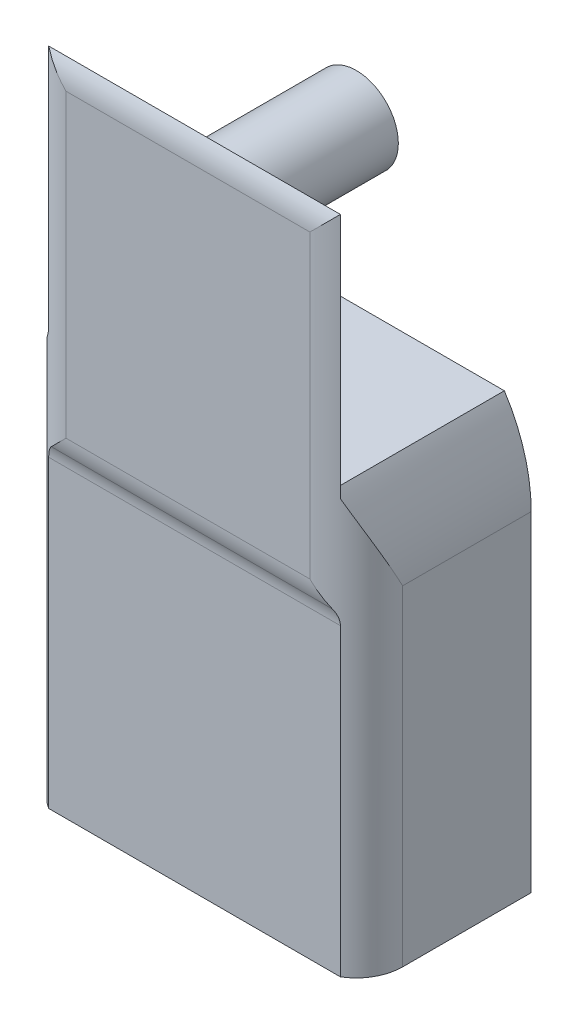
ISO-10303-21;
HEADER;
FILE_DESCRIPTION(('STEP AP214'),'2;1');
FILE_NAME('part.step','',(''),(''),'','','');
FILE_SCHEMA(('AUTOMOTIVE_DESIGN { 1 0 10303 214 1 1 1 1 }'));
ENDSEC;
DATA;
#1=APPLICATION_CONTEXT('core data for automotive mechanical design processes');
#2=APPLICATION_PROTOCOL_DEFINITION('international standard','automotive_design',2000,#1);
#3=PRODUCT_CONTEXT('',#1,'mechanical');
#4=PRODUCT('Part','Part','',(#3));
#5=PRODUCT_RELATED_PRODUCT_CATEGORY('part','',(#4));
#6=PRODUCT_DEFINITION_FORMATION('','',#4);
#7=PRODUCT_DEFINITION_CONTEXT('part definition',#1,'design');
#8=PRODUCT_DEFINITION('design','',#6,#7);
#9=PRODUCT_DEFINITION_SHAPE('','',#8);
#10=(LENGTH_UNIT() NAMED_UNIT(*) SI_UNIT(.MILLI.,.METRE.));
#11=(NAMED_UNIT(*) PLANE_ANGLE_UNIT() SI_UNIT($,.RADIAN.));
#12=(NAMED_UNIT(*) SI_UNIT($,.STERADIAN.) SOLID_ANGLE_UNIT());
#13=UNCERTAINTY_MEASURE_WITH_UNIT(LENGTH_MEASURE(1.E-05),#10,'distance_accuracy_value','');
#14=(GEOMETRIC_REPRESENTATION_CONTEXT(3) GLOBAL_UNCERTAINTY_ASSIGNED_CONTEXT((#13)) GLOBAL_UNIT_ASSIGNED_CONTEXT((#10,
#11,#12)) REPRESENTATION_CONTEXT('',''));
#15=CARTESIAN_POINT('',(0.,0.,0.));
#16=DIRECTION('',(0.,0.,1.));
#17=DIRECTION('',(1.,0.,0.));
#18=AXIS2_PLACEMENT_3D('',#15,#16,#17);
#19=CARTESIAN_POINT('',(25.4,49.8,25.4));
#20=DIRECTION('',(0.,0.,-1.));
#21=DIRECTION('',(-1.,0.,0.));
#22=AXIS2_PLACEMENT_3D('',#19,#20,#21);
#23=CYLINDRICAL_SURFACE('',#22,25.4);
#24=DIRECTION('',(0.,0.,-1.));
#25=VECTOR('',#24,1.);
#26=CARTESIAN_POINT('',(0.,49.8,25.4));
#27=LINE('',#26,#25);
#28=CARTESIAN_POINT('',(0.,49.8,19.4));
#29=VERTEX_POINT('',#28);
#30=CARTESIAN_POINT('',(0.,49.8,0.));
#31=VERTEX_POINT('',#30);
#32=EDGE_CURVE('E188',#29,#31,#27,.T.);
#33=ORIENTED_EDGE('',*,*,#32,.F.);
#34=CARTESIAN_POINT('',(3.39444872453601,62.4852557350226,25.4));
#35=CARTESIAN_POINT('',(3.25261574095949,62.2392116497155,25.3147540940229));
#36=CARTESIAN_POINT('',(3.11551853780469,61.9918488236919,25.2255386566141));
#37=CARTESIAN_POINT('',(2.85071777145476,61.4948343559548,25.0400028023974));
#38=CARTESIAN_POINT('',(2.72301238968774,61.24518316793,24.943683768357));
#39=CARTESIAN_POINT('',(2.47698744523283,60.7440996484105,24.7448421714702));
#40=CARTESIAN_POINT('',(2.35865847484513,60.4926693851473,24.6423260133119));
#41=CARTESIAN_POINT('',(2.13112207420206,59.9880292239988,24.4317056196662));
#42=CARTESIAN_POINT('',(2.02191514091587,59.7348192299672,24.3236010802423));
#43=CARTESIAN_POINT('',(1.70820183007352,58.9738431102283,23.9923087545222));
#44=CARTESIAN_POINT('',(1.51709934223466,58.4637011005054,23.7617289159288));
#45=CARTESIAN_POINT('',(1.16977300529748,57.4386590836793,23.2852791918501));
#46=CARTESIAN_POINT('',(1.01355929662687,56.9237577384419,23.0394048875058));
#47=CARTESIAN_POINT('',(0.72793303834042,55.8634934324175,22.5229328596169));
#48=CARTESIAN_POINT('',(0.600340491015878,55.3179408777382,22.2517144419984));
#49=CARTESIAN_POINT('',(0.382062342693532,54.2242426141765,21.7001943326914));
#50=CARTESIAN_POINT('',(0.291377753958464,53.6760968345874,21.4198923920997));
#51=CARTESIAN_POINT('',(0.0738786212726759,52.0297838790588,20.5705382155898));
#52=CARTESIAN_POINT('',(0.00123755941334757,50.9283089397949,19.9923249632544));
#53=CARTESIAN_POINT('',(5.22997711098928E-06,49.8188147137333,19.409877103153));
#54=CARTESIAN_POINT('',(3.8196601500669E-09,49.8094073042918,19.4049385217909));
#55=CARTESIAN_POINT('',(0.,49.8,19.4));
#56=B_SPLINE_CURVE_WITH_KNOTS('',3,(#34,#35,#36,#37,#38,#39,#40,#41,#42,#43,#44,#45,#46,#47,#48,
#49,#50,#51,#52,#53,#54,#55),.UNSPECIFIED.,.F.,.F.,(4,2,2,2,2,2,2,2,2,2,4),(0.,
0.889433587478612,1.77869449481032,2.66705156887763,3.55545700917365,5.32862058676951,
7.10229886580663,8.96837070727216,10.8344937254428,14.5618344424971,14.5937092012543),.UNSPECIFIED.);
#57=CARTESIAN_POINT('',(3.39444872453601,62.4852557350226,25.4));
#58=VERTEX_POINT('',#57);
#59=EDGE_CURVE('E12',#29,#58,#56,.F.);
#60=ORIENTED_EDGE('',*,*,#59,.T.);
#61=CARTESIAN_POINT('',(25.4,49.8,25.4));
#62=DIRECTION('',(0.,0.,-1.));
#63=DIRECTION('',(-1.,0.,0.));
#64=AXIS2_PLACEMENT_3D('',#61,#62,#63);
#65=CIRCLE('',#64,25.4);
#66=CARTESIAN_POINT('',(4.05145125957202,63.5622478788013,25.4));
#67=VERTEX_POINT('',#66);
#68=EDGE_CURVE('E189',#67,#58,#65,.F.);
#69=ORIENTED_EDGE('',*,*,#68,.F.);
#70=DIRECTION('',(0.,0.,-1.));
#71=VECTOR('',#70,1.);
#72=CARTESIAN_POINT('',(4.05145125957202,63.5622478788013,25.4));
#73=LINE('',#72,#71);
#74=CARTESIAN_POINT('',(4.05145125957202,63.5622478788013,0.));
#75=VERTEX_POINT('',#74);
#76=EDGE_CURVE('E196',#67,#75,#73,.T.);
#77=ORIENTED_EDGE('',*,*,#76,.T.);
#78=CARTESIAN_POINT('',(25.4,49.8,0.));
#79=DIRECTION('',(0.,0.,-1.));
#80=DIRECTION('',(-1.,0.,0.));
#81=AXIS2_PLACEMENT_3D('',#78,#79,#80);
#82=CIRCLE('',#81,25.4);
#83=EDGE_CURVE('E209',#75,#31,#82,.F.);
#84=ORIENTED_EDGE('',*,*,#83,.T.);
#85=EDGE_LOOP('',(#33,#60,#69,#77,#84));
#86=FACE_BOUND('',#85,.T.);
#87=ADVANCED_FACE('F79',(#86),#23,.T.);
#88=CARTESIAN_POINT('',(0.,0.,0.));
#89=DIRECTION('',(0.,0.,1.));
#90=DIRECTION('',(1.,0.,0.));
#91=AXIS2_PLACEMENT_3D('',#88,#89,#90);
#92=PLANE('',#91);
#93=ORIENTED_EDGE('',*,*,#83,.F.);
#94=DIRECTION('',(-1.,0.,0.));
#95=VECTOR('',#94,1.);
#96=CARTESIAN_POINT('',(46.748548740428,63.5622478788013,0.));
#97=LINE('',#96,#95);
#98=CARTESIAN_POINT('',(46.748548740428,63.5622478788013,0.));
#99=VERTEX_POINT('',#98);
#100=EDGE_CURVE('E198',#99,#75,#97,.T.);
#101=ORIENTED_EDGE('',*,*,#100,.F.);
#102=CARTESIAN_POINT('',(50.8,49.8,0.));
#103=VERTEX_POINT('',#102);
#104=EDGE_CURVE('E203',#103,#99,#82,.F.);
#105=ORIENTED_EDGE('',*,*,#104,.F.);
#106=DIRECTION('',(0.,1.,0.));
#107=VECTOR('',#106,1.);
#108=CARTESIAN_POINT('',(50.8,0.,0.));
#109=LINE('',#108,#107);
#110=CARTESIAN_POINT('',(50.8,0.,0.));
#111=VERTEX_POINT('',#110);
#112=EDGE_CURVE('E226',#111,#103,#109,.T.);
#113=ORIENTED_EDGE('',*,*,#112,.F.);
#114=DIRECTION('',(1.,0.,0.));
#115=VECTOR('',#114,1.);
#116=CARTESIAN_POINT('',(0.,0.,0.));
#117=LINE('',#116,#115);
#118=CARTESIAN_POINT('',(0.,0.,0.));
#119=VERTEX_POINT('',#118);
#120=EDGE_CURVE('E229',#119,#111,#117,.T.);
#121=ORIENTED_EDGE('',*,*,#120,.F.);
#122=DIRECTION('',(0.,-1.,0.));
#123=VECTOR('',#122,1.);
#124=CARTESIAN_POINT('',(0.,0.,0.));
#125=LINE('',#124,#123);
#126=EDGE_CURVE('E221',#31,#119,#125,.T.);
#127=ORIENTED_EDGE('',*,*,#126,.F.);
#128=EDGE_LOOP('',(#93,#101,#105,#113,#121,#127));
#129=FACE_BOUND('',#128,.T.);
#130=ADVANCED_FACE('F301',(#129),#92,.F.);
#131=CARTESIAN_POINT('',(0.,0.,25.4));
#132=DIRECTION('',(1.,0.,0.));
#133=DIRECTION('',(0.,1.,0.));
#134=AXIS2_PLACEMENT_3D('',#131,#132,#133);
#135=PLANE('',#134);
#136=DIRECTION('',(0.,0.,-1.));
#137=VECTOR('',#136,1.);
#138=CARTESIAN_POINT('',(0.,0.,25.4));
#139=LINE('',#138,#137);
#140=CARTESIAN_POINT('',(0.,0.,19.4));
#141=VERTEX_POINT('',#140);
#142=EDGE_CURVE('E235',#141,#119,#139,.T.);
#143=ORIENTED_EDGE('',*,*,#142,.F.);
#144=DIRECTION('',(0.,-1.,0.));
#145=VECTOR('',#144,1.);
#146=CARTESIAN_POINT('',(0.,99.6378787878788,19.4));
#147=LINE('',#146,#145);
#148=EDGE_CURVE('E89',#141,#29,#147,.F.);
#149=ORIENTED_EDGE('',*,*,#148,.T.);
#150=ORIENTED_EDGE('',*,*,#32,.T.);
#151=ORIENTED_EDGE('',*,*,#126,.T.);
#152=EDGE_LOOP('',(#143,#149,#150,#151));
#153=FACE_BOUND('',#152,.T.);
#154=ADVANCED_FACE('F304',(#153),#135,.F.);
#155=CARTESIAN_POINT('',(0.,0.,25.4));
#156=DIRECTION('',(0.,1.,0.));
#157=DIRECTION('',(0.,0.,1.));
#158=AXIS2_PLACEMENT_3D('',#155,#156,#157);
#159=PLANE('',#158);
#160=DIRECTION('',(0.,0.,-1.));
#161=VECTOR('',#160,1.);
#162=CARTESIAN_POINT('',(50.8,0.,25.4));
#163=LINE('',#162,#161);
#164=CARTESIAN_POINT('',(50.8,0.,19.4));
#165=VERTEX_POINT('',#164);
#166=EDGE_CURVE('E225',#165,#111,#163,.T.);
#167=ORIENTED_EDGE('',*,*,#166,.F.);
#168=CARTESIAN_POINT('',(43.8,0.,19.4));
#169=DIRECTION('',(0.,1.,0.));
#170=DIRECTION('',(0.,0.,1.));
#171=AXIS2_PLACEMENT_3D('',#168,#169,#170);
#172=CIRCLE('',#171,7.);
#173=CARTESIAN_POINT('',(47.405551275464,0.,25.4));
#174=VERTEX_POINT('',#173);
#175=EDGE_CURVE('E325',#165,#174,#172,.F.);
#176=ORIENTED_EDGE('',*,*,#175,.T.);
#177=DIRECTION('',(1.,0.,0.));
#178=VECTOR('',#177,1.);
#179=CARTESIAN_POINT('',(0.,0.,25.4));
#180=LINE('',#179,#178);
#181=CARTESIAN_POINT('',(3.39444872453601,0.,25.4));
#182=VERTEX_POINT('',#181);
#183=EDGE_CURVE('E222',#182,#174,#180,.T.);
#184=ORIENTED_EDGE('',*,*,#183,.F.);
#185=CARTESIAN_POINT('',(7.,0.,19.4));
#186=DIRECTION('',(0.,1.,0.));
#187=DIRECTION('',(0.,0.,1.));
#188=AXIS2_PLACEMENT_3D('',#185,#186,#187);
#189=CIRCLE('',#188,7.);
#190=EDGE_CURVE('E324',#182,#141,#189,.F.);
#191=ORIENTED_EDGE('',*,*,#190,.T.);
#192=ORIENTED_EDGE('',*,*,#142,.T.);
#193=ORIENTED_EDGE('',*,*,#120,.T.);
#194=EDGE_LOOP('',(#167,#176,#184,#191,#192,#193));
#195=FACE_BOUND('',#194,.T.);
#196=ADVANCED_FACE('F322',(#195),#159,.F.);
#197=CARTESIAN_POINT('',(50.8,0.,25.4));
#198=DIRECTION('',(-1.,0.,0.));
#199=DIRECTION('',(0.,0.,1.));
#200=AXIS2_PLACEMENT_3D('',#197,#198,#199);
#201=PLANE('',#200);
#202=DIRECTION('',(0.,0.,-1.));
#203=VECTOR('',#202,1.);
#204=CARTESIAN_POINT('',(50.8,49.8,25.4));
#205=LINE('',#204,#203);
#206=CARTESIAN_POINT('',(50.8,49.8,19.4));
#207=VERTEX_POINT('',#206);
#208=EDGE_CURVE('E205',#207,#103,#205,.T.);
#209=ORIENTED_EDGE('',*,*,#208,.F.);
#210=DIRECTION('',(0.,1.,0.));
#211=VECTOR('',#210,1.);
#212=CARTESIAN_POINT('',(50.8,48.8937448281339,19.4));
#213=LINE('',#212,#211);
#214=EDGE_CURVE('E260',#207,#165,#213,.F.);
#215=ORIENTED_EDGE('',*,*,#214,.T.);
#216=ORIENTED_EDGE('',*,*,#166,.T.);
#217=ORIENTED_EDGE('',*,*,#112,.T.);
#218=EDGE_LOOP('',(#209,#215,#216,#217));
#219=FACE_BOUND('',#218,.T.);
#220=ADVANCED_FACE('F319',(#219),#201,.F.);
#221=CARTESIAN_POINT('',(0.,0.,25.4));
#222=DIRECTION('',(0.,0.,1.));
#223=DIRECTION('',(1.,0.,0.));
#224=AXIS2_PLACEMENT_3D('',#221,#222,#223);
#225=PLANE('',#224);
#226=ORIENTED_EDGE('',*,*,#183,.T.);
#227=DIRECTION('',(0.,-1.,0.));
#228=VECTOR('',#227,1.);
#229=CARTESIAN_POINT('',(47.405551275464,0.,25.4));
#230=LINE('',#229,#228);
#231=CARTESIAN_POINT('',(47.405551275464,45.8937448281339,25.4));
#232=VERTEX_POINT('',#231);
#233=EDGE_CURVE('E330',#174,#232,#230,.F.);
#234=ORIENTED_EDGE('',*,*,#233,.T.);
#235=DIRECTION('',(-1.,0.,0.));
#236=VECTOR('',#235,1.);
#237=CARTESIAN_POINT('',(0.,45.8937448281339,25.4));
#238=LINE('',#237,#236);
#239=CARTESIAN_POINT('',(3.39444872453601,45.8937448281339,25.4));
#240=VERTEX_POINT('',#239);
#241=EDGE_CURVE('E237',#232,#240,#238,.T.);
#242=ORIENTED_EDGE('',*,*,#241,.T.);
#243=DIRECTION('',(0.,1.,0.));
#244=VECTOR('',#243,1.);
#245=CARTESIAN_POINT('',(3.39444872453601,45.8937448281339,25.4));
#246=LINE('',#245,#244);
#247=EDGE_CURVE('E326',#240,#182,#246,.F.);
#248=ORIENTED_EDGE('',*,*,#247,.T.);
#249=EDGE_LOOP('',(#226,#234,#242,#248));
#250=FACE_BOUND('',#249,.T.);
#251=ADVANCED_FACE('F351',(#250),#225,.T.);
#252=CARTESIAN_POINT('',(0.,0.,26.4));
#253=DIRECTION('',(0.,0.,1.));
#254=DIRECTION('',(1.,0.,0.));
#255=AXIS2_PLACEMENT_3D('',#252,#253,#254);
#256=PLANE('',#255);
#257=DIRECTION('',(-1.,0.,0.));
#258=VECTOR('',#257,1.);
#259=CARTESIAN_POINT('',(50.8,50.6895763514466,26.4));
#260=LINE('',#259,#258);
#261=CARTESIAN_POINT('',(7.,50.6895763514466,26.4));
#262=VERTEX_POINT('',#261);
#263=CARTESIAN_POINT('',(43.8,50.6895763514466,26.4));
#264=VERTEX_POINT('',#263);
#265=EDGE_CURVE('E244',#262,#264,#260,.F.);
#266=ORIENTED_EDGE('',*,*,#265,.T.);
#267=DIRECTION('',(0.,1.,0.));
#268=VECTOR('',#267,1.);
#269=CARTESIAN_POINT('',(43.8,99.6378787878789,26.4));
#270=LINE('',#269,#268);
#271=CARTESIAN_POINT('',(43.8,96.0323275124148,26.4));
#272=VERTEX_POINT('',#271);
#273=EDGE_CURVE('E246',#264,#272,#270,.T.);
#274=ORIENTED_EDGE('',*,*,#273,.T.);
#275=DIRECTION('',(-1.,0.,0.));
#276=VECTOR('',#275,1.);
#277=CARTESIAN_POINT('',(0.,96.0323275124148,26.4));
#278=LINE('',#277,#276);
#279=CARTESIAN_POINT('',(7.,96.0323275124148,26.4));
#280=VERTEX_POINT('',#279);
#281=EDGE_CURVE('E240',#272,#280,#278,.T.);
#282=ORIENTED_EDGE('',*,*,#281,.T.);
#283=DIRECTION('',(0.,-1.,0.));
#284=VECTOR('',#283,1.);
#285=CARTESIAN_POINT('',(7.,48.8937448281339,26.4));
#286=LINE('',#285,#284);
#287=EDGE_CURVE('E242',#280,#262,#286,.T.);
#288=ORIENTED_EDGE('',*,*,#287,.T.);
#289=EDGE_LOOP('',(#266,#274,#282,#288));
#290=FACE_BOUND('',#289,.T.);
#291=ADVANCED_FACE('F355',(#290),#256,.T.);
#292=CARTESIAN_POINT('',(0.,0.,25.4));
#293=DIRECTION('',(0.,0.,1.));
#294=DIRECTION('',(1.,0.,0.));
#295=AXIS2_PLACEMENT_3D('',#292,#293,#294);
#296=PLANE('',#295);
#297=DIRECTION('',(1.,0.,0.));
#298=VECTOR('',#297,1.);
#299=CARTESIAN_POINT('',(0.,99.6378787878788,25.4));
#300=LINE('',#299,#298);
#301=CARTESIAN_POINT('',(3.39444872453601,99.6378787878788,25.4));
#302=VERTEX_POINT('',#301);
#303=CARTESIAN_POINT('',(47.405551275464,99.6378787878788,25.4));
#304=VERTEX_POINT('',#303);
#305=EDGE_CURVE('E219',#302,#304,#300,.T.);
#306=ORIENTED_EDGE('',*,*,#305,.T.);
#307=DIRECTION('',(0.,-1.,0.));
#308=VECTOR('',#307,1.);
#309=CARTESIAN_POINT('',(47.405551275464,99.6378787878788,25.4));
#310=LINE('',#309,#308);
#311=CARTESIAN_POINT('',(47.405551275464,62.4852557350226,25.4));
#312=VERTEX_POINT('',#311);
#313=EDGE_CURVE('E184',#304,#312,#310,.T.);
#314=ORIENTED_EDGE('',*,*,#313,.T.);
#315=CARTESIAN_POINT('',(46.748548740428,63.5622478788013,25.4));
#316=VERTEX_POINT('',#315);
#317=EDGE_CURVE('E176',#312,#316,#65,.F.);
#318=ORIENTED_EDGE('',*,*,#317,.T.);
#319=DIRECTION('',(-1.,0.,0.));
#320=VECTOR('',#319,1.);
#321=CARTESIAN_POINT('',(46.748548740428,63.5622478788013,25.4));
#322=LINE('',#321,#320);
#323=EDGE_CURVE('E181',#316,#67,#322,.T.);
#324=ORIENTED_EDGE('',*,*,#323,.T.);
#325=ORIENTED_EDGE('',*,*,#68,.T.);
#326=DIRECTION('',(0.,1.,0.));
#327=VECTOR('',#326,1.);
#328=CARTESIAN_POINT('',(3.39444872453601,62.4852557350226,25.4));
#329=LINE('',#328,#327);
#330=EDGE_CURVE('E249',#58,#302,#329,.T.);
#331=ORIENTED_EDGE('',*,*,#330,.T.);
#332=EDGE_LOOP('',(#306,#314,#318,#324,#325,#331));
#333=FACE_BOUND('',#332,.T.);
#334=CARTESIAN_POINT('',(25.4,88.9,25.4));
#335=DIRECTION('',(0.,0.,1.));
#336=DIRECTION('',(1.,0.,0.));
#337=AXIS2_PLACEMENT_3D('',#334,#335,#336);
#338=CIRCLE('',#337,6.35);
#339=CARTESIAN_POINT('',(31.75,88.9,25.4));
#340=VERTEX_POINT('',#339);
#341=EDGE_CURVE('E216',#340,#340,#338,.T.);
#342=ORIENTED_EDGE('',*,*,#341,.T.);
#343=EDGE_LOOP('',(#342));
#344=FACE_BOUND('',#343,.T.);
#345=ADVANCED_FACE('F178',(#333,#344),#296,.F.);
#346=CARTESIAN_POINT('',(25.4,88.9,1.));
#347=DIRECTION('',(0.,0.,1.));
#348=DIRECTION('',(1.,0.,0.));
#349=AXIS2_PLACEMENT_3D('',#346,#347,#348);
#350=PLANE('',#349);
#351=CARTESIAN_POINT('',(25.4,88.9,1.));
#352=DIRECTION('',(0.,0.,1.));
#353=DIRECTION('',(1.,0.,0.));
#354=AXIS2_PLACEMENT_3D('',#351,#352,#353);
#355=CIRCLE('',#354,6.35);
#356=CARTESIAN_POINT('',(31.75,88.9,1.));
#357=VERTEX_POINT('',#356);
#358=EDGE_CURVE('E213',#357,#357,#355,.T.);
#359=ORIENTED_EDGE('',*,*,#358,.F.);
#360=EDGE_LOOP('',(#359));
#361=FACE_BOUND('',#360,.T.);
#362=ADVANCED_FACE('F272',(#361),#350,.F.);
#363=CARTESIAN_POINT('',(25.4,88.9,1.));
#364=DIRECTION('',(0.,0.,1.));
#365=DIRECTION('',(1.,0.,0.));
#366=AXIS2_PLACEMENT_3D('',#363,#364,#365);
#367=CYLINDRICAL_SURFACE('',#366,6.35);
#368=ORIENTED_EDGE('',*,*,#358,.T.);
#369=EDGE_LOOP('',(#368));
#370=FACE_BOUND('',#369,.T.);
#371=ORIENTED_EDGE('',*,*,#341,.F.);
#372=EDGE_LOOP('',(#371));
#373=FACE_BOUND('',#372,.T.);
#374=ADVANCED_FACE('F271',(#370,#373),#367,.T.);
#375=ORIENTED_EDGE('',*,*,#317,.F.);
#376=CARTESIAN_POINT('',(47.405551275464,62.4852557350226,25.4));
#377=CARTESIAN_POINT('',(47.5473842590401,62.2392116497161,25.3147540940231));
#378=CARTESIAN_POINT('',(47.6844814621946,61.9918488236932,25.2255386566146));
#379=CARTESIAN_POINT('',(47.9492822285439,61.4948343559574,25.0400028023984));
#380=CARTESIAN_POINT('',(48.0769876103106,61.2451831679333,24.9436837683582));
#381=CARTESIAN_POINT('',(48.323012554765,60.744099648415,24.744842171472));
#382=CARTESIAN_POINT('',(48.4413415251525,60.4926693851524,24.642326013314));
#383=CARTESIAN_POINT('',(48.6688779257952,59.9880292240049,24.4317056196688));
#384=CARTESIAN_POINT('',(48.7780848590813,59.7348192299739,24.3236010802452));
#385=CARTESIAN_POINT('',(49.0917981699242,58.9738431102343,23.9923087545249));
#386=CARTESIAN_POINT('',(49.2829006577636,58.46370110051,23.7617289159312));
#387=CARTESIAN_POINT('',(49.6302269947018,57.4386590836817,23.285279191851));
#388=CARTESIAN_POINT('',(49.7864407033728,56.9237577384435,23.0394048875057));
#389=CARTESIAN_POINT('',(50.0720669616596,55.863493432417,22.5229328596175));
#390=CARTESIAN_POINT('',(50.1996595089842,55.3179408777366,22.251714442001));
#391=CARTESIAN_POINT('',(50.4179376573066,54.2242426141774,21.7001943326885));
#392=CARTESIAN_POINT('',(50.5086222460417,53.676096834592,21.4198923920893));
#393=CARTESIAN_POINT('',(50.7261213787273,52.0297838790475,20.5705382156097));
#394=CARTESIAN_POINT('',(50.7987624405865,50.9283089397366,19.9923249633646));
#395=CARTESIAN_POINT('',(50.7999947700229,49.8188147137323,19.4098771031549));
#396=CARTESIAN_POINT('',(50.7999999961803,49.8094073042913,19.4049385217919));
#397=CARTESIAN_POINT('',(50.8,49.8,19.4));
#398=B_SPLINE_CURVE_WITH_KNOTS('',3,(#376,#377,#378,#379,#380,#381,#382,#383,#384,#385,#386,
#387,#388,#389,#390,#391,#392,#393,#394,#395,#396,#397),.UNSPECIFIED.,.F.,.F.,(4,2,2,2,2,2,2,2,
2,2,4),(0.,0.889433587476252,1.7786944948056,2.66705156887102,3.55545700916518,5.3286205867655,
7.10229886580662,8.96837070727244,10.8344937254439,14.5618344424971,14.5937092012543),.UNSPECIFIED.);
#399=EDGE_CURVE('E252',#312,#207,#398,.T.);
#400=ORIENTED_EDGE('',*,*,#399,.T.);
#401=ORIENTED_EDGE('',*,*,#208,.T.);
#402=ORIENTED_EDGE('',*,*,#104,.T.);
#403=DIRECTION('',(0.,0.,-1.));
#404=VECTOR('',#403,1.);
#405=CARTESIAN_POINT('',(46.748548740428,63.5622478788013,25.4));
#406=LINE('',#405,#404);
#407=EDGE_CURVE('E193',#316,#99,#406,.T.);
#408=ORIENTED_EDGE('',*,*,#407,.F.);
#409=EDGE_LOOP('',(#375,#400,#401,#402,#408));
#410=FACE_BOUND('',#409,.T.);
#411=ADVANCED_FACE('F201',(#410),#23,.T.);
#412=CARTESIAN_POINT('',(0.,45.8937448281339,30.4));
#413=DIRECTION('',(1.,0.,0.));
#414=DIRECTION('',(0.,0.,-1.));
#415=AXIS2_PLACEMENT_3D('',#412,#413,#414);
#416=CYLINDRICAL_SURFACE('',#415,5.);
#417=ORIENTED_EDGE('',*,*,#241,.F.);
#418=CARTESIAN_POINT('',(47.405551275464,45.8937448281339,25.4));
#419=CARTESIAN_POINT('',(47.4055565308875,45.9701354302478,25.3999848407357));
#420=CARTESIAN_POINT('',(47.4026381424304,46.0465204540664,25.4017502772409));
#421=CARTESIAN_POINT('',(47.3909955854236,46.198673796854,25.4087298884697));
#422=CARTESIAN_POINT('',(47.3822725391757,46.2744422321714,25.4139433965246));
#423=CARTESIAN_POINT('',(47.3591034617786,46.4245192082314,25.4276822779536));
#424=CARTESIAN_POINT('',(47.3446779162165,46.4988319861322,25.4361957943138));
#425=CARTESIAN_POINT('',(47.310201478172,46.6456921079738,25.4563091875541));
#426=CARTESIAN_POINT('',(47.2901506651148,46.7182394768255,25.4679090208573));
#427=CARTESIAN_POINT('',(47.2217160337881,46.9324421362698,25.5069348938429));
#428=CARTESIAN_POINT('',(47.1650307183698,47.0707827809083,25.5385994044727));
#429=CARTESIAN_POINT('',(47.0310327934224,47.3346494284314,25.610163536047));
#430=CARTESIAN_POINT('',(46.9537222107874,47.4601766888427,25.6500623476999));
#431=CARTESIAN_POINT('',(46.8262161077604,47.6339332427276,25.7122187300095));
#432=CARTESIAN_POINT('',(46.7831032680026,47.6881360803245,25.7327366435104));
#433=CARTESIAN_POINT('',(46.693112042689,47.7928333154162,25.7743516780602));
#434=CARTESIAN_POINT('',(46.646243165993,47.8433364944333,25.7954472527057));
#435=CARTESIAN_POINT('',(46.5975683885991,47.8920079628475,25.8166666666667));
#436=B_SPLINE_CURVE_WITH_KNOTS('',3,(#418,#419,#420,#421,#422,#423,#424,#425,#426,#427,#428,
#429,#430,#431,#432,#433,#434,#435),.UNSPECIFIED.,.F.,.F.,(4,2,2,2,2,2,2,2,4),(0.,
0.229086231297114,0.458128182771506,0.686354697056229,0.914577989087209,1.37064914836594,
1.82667550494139,2.04320909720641,2.25921084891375),.UNSPECIFIED.);
#437=CARTESIAN_POINT('',(46.5975683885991,47.8920079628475,25.8166666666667));
#438=VERTEX_POINT('',#437);
#439=EDGE_CURVE('E104',#232,#438,#436,.T.);
#440=ORIENTED_EDGE('',*,*,#439,.T.);
#441=DIRECTION('',(1.,0.,0.));
#442=VECTOR('',#441,1.);
#443=CARTESIAN_POINT('',(0.,47.8920079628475,25.8166666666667));
#444=LINE('',#443,#442);
#445=CARTESIAN_POINT('',(4.20243161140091,47.8920079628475,25.8166666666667));
#446=VERTEX_POINT('',#445);
#447=EDGE_CURVE('E338',#438,#446,#444,.F.);
#448=ORIENTED_EDGE('',*,*,#447,.T.);
#449=CARTESIAN_POINT('',(4.20243161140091,47.8920079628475,25.8166666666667));
#450=CARTESIAN_POINT('',(4.15066422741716,47.8402439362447,25.7940997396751));
#451=CARTESIAN_POINT('',(4.10094049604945,47.7864088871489,25.7716723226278));
#452=CARTESIAN_POINT('',(4.00585398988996,47.6746958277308,25.7275453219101));
#453=CARTESIAN_POINT('',(3.96049317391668,47.6168160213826,25.7058460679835));
#454=CARTESIAN_POINT('',(3.83127609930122,47.437112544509,25.6424678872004));
#455=CARTESIAN_POINT('',(3.75447609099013,47.3094143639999,25.6025941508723));
#456=CARTESIAN_POINT('',(3.62184650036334,47.0408723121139,25.5313791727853));
#457=CARTESIAN_POINT('',(3.56608451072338,46.8999878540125,25.500065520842));
#458=CARTESIAN_POINT('',(3.4774293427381,46.6094708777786,25.4493089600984));
#459=CARTESIAN_POINT('',(3.4444715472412,46.4598643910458,25.4298325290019));
#460=CARTESIAN_POINT('',(3.41365085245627,46.2397141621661,25.4115056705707));
#461=CARTESIAN_POINT('',(3.40645349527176,46.1707868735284,25.4072011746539));
#462=CARTESIAN_POINT('',(3.39685487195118,46.0325002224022,25.4014469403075));
#463=CARTESIAN_POINT('',(3.39445225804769,45.9631409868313,25.3999963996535));
#464=CARTESIAN_POINT('',(3.39444872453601,45.8937448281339,25.4));
#465=B_SPLINE_CURVE_WITH_KNOTS('',3,(#449,#450,#451,#452,#453,#454,#455,#456,#457,#458,#459,
#460,#461,#462,#463,#464),.UNSPECIFIED.,.F.,.F.,(4,2,2,2,2,2,2,4),(0.,0.229712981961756,
0.459528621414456,0.919997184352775,1.38193282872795,1.84255412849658,2.05067137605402,
2.25873011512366),.UNSPECIFIED.);
#466=EDGE_CURVE('E332',#446,#240,#465,.T.);
#467=ORIENTED_EDGE('',*,*,#466,.T.);
#468=EDGE_LOOP('',(#417,#440,#448,#467));
#469=FACE_BOUND('',#468,.T.);
#470=ADVANCED_FACE('F270',(#469),#416,.F.);
#471=CARTESIAN_POINT('',(46.748548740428,63.5622478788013,25.4));
#472=DIRECTION('',(0.,-1.,0.));
#473=DIRECTION('',(0.,0.,-1.));
#474=AXIS2_PLACEMENT_3D('',#471,#472,#473);
#475=PLANE('',#474);
#476=ORIENTED_EDGE('',*,*,#100,.T.);
#477=ORIENTED_EDGE('',*,*,#76,.F.);
#478=ORIENTED_EDGE('',*,*,#323,.F.);
#479=ORIENTED_EDGE('',*,*,#407,.T.);
#480=EDGE_LOOP('',(#476,#477,#478,#479));
#481=FACE_BOUND('',#480,.T.);
#482=ADVANCED_FACE('F192',(#481),#475,.F.);
#483=CARTESIAN_POINT('',(7.,0.,19.4));
#484=DIRECTION('',(0.,1.,0.));
#485=DIRECTION('',(-1.,0.,0.));
#486=AXIS2_PLACEMENT_3D('',#483,#484,#485);
#487=CYLINDRICAL_SURFACE('',#486,7.);
#488=ORIENTED_EDGE('',*,*,#247,.F.);
#489=ORIENTED_EDGE('',*,*,#466,.F.);
#490=CARTESIAN_POINT('',(7.,50.6895763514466,19.4));
#491=DIRECTION('',(-0.707106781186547,0.707106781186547,0.));
#492=DIRECTION('',(0.707106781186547,0.707106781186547,0.));
#493=AXIS2_PLACEMENT_3D('',#490,#491,#492);
#494=ELLIPSE('',#493,9.89949493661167,7.);
#495=EDGE_CURVE('E84',#262,#446,#494,.F.);
#496=ORIENTED_EDGE('',*,*,#495,.F.);
#497=ORIENTED_EDGE('',*,*,#287,.F.);
#498=CARTESIAN_POINT('',(7.,96.0323275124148,19.4));
#499=DIRECTION('',(0.707106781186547,0.707106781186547,0.));
#500=DIRECTION('',(0.707106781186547,-0.707106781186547,0.));
#501=AXIS2_PLACEMENT_3D('',#498,#499,#500);
#502=ELLIPSE('',#501,9.89949493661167,7.);
#503=EDGE_CURVE('E286',#302,#280,#502,.T.);
#504=ORIENTED_EDGE('',*,*,#503,.F.);
#505=ORIENTED_EDGE('',*,*,#330,.F.);
#506=ORIENTED_EDGE('',*,*,#59,.F.);
#507=ORIENTED_EDGE('',*,*,#148,.F.);
#508=ORIENTED_EDGE('',*,*,#190,.F.);
#509=EDGE_LOOP('',(#488,#489,#496,#497,#504,#505,#506,#507,#508));
#510=FACE_BOUND('',#509,.T.);
#511=ADVANCED_FACE('F81',(#510),#487,.T.);
#512=CARTESIAN_POINT('',(0.,50.6895763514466,19.4));
#513=DIRECTION('',(1.,0.,0.));
#514=DIRECTION('',(0.,0.,-1.));
#515=AXIS2_PLACEMENT_3D('',#512,#513,#514);
#516=CYLINDRICAL_SURFACE('',#515,7.);
#517=ORIENTED_EDGE('',*,*,#495,.T.);
#518=ORIENTED_EDGE('',*,*,#447,.F.);
#519=CARTESIAN_POINT('',(43.8,50.6895763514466,19.4));
#520=DIRECTION('',(0.707106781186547,0.707106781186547,0.));
#521=DIRECTION('',(0.707106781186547,-0.707106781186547,0.));
#522=AXIS2_PLACEMENT_3D('',#519,#520,#521);
#523=ELLIPSE('',#522,9.89949493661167,7.);
#524=EDGE_CURVE('E284',#264,#438,#523,.T.);
#525=ORIENTED_EDGE('',*,*,#524,.F.);
#526=ORIENTED_EDGE('',*,*,#265,.F.);
#527=EDGE_LOOP('',(#517,#518,#525,#526));
#528=FACE_BOUND('',#527,.T.);
#529=ADVANCED_FACE('F353',(#528),#516,.T.);
#530=CARTESIAN_POINT('',(0.,96.0323275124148,19.4));
#531=DIRECTION('',(1.,0.,0.));
#532=DIRECTION('',(0.,0.,-1.));
#533=AXIS2_PLACEMENT_3D('',#530,#531,#532);
#534=CYLINDRICAL_SURFACE('',#533,7.);
#535=ORIENTED_EDGE('',*,*,#503,.T.);
#536=ORIENTED_EDGE('',*,*,#281,.F.);
#537=CARTESIAN_POINT('',(43.8,96.0323275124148,19.4));
#538=DIRECTION('',(0.707106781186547,-0.707106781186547,0.));
#539=DIRECTION('',(0.707106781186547,0.707106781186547,0.));
#540=AXIS2_PLACEMENT_3D('',#537,#538,#539);
#541=ELLIPSE('',#540,9.89949493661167,7.);
#542=EDGE_CURVE('E282',#304,#272,#541,.T.);
#543=ORIENTED_EDGE('',*,*,#542,.F.);
#544=ORIENTED_EDGE('',*,*,#305,.F.);
#545=EDGE_LOOP('',(#535,#536,#543,#544));
#546=FACE_BOUND('',#545,.T.);
#547=ADVANCED_FACE('F312',(#546),#534,.T.);
#548=CARTESIAN_POINT('',(43.8,0.,19.4));
#549=DIRECTION('',(0.,-1.,0.));
#550=DIRECTION('',(0.,0.,-1.));
#551=AXIS2_PLACEMENT_3D('',#548,#549,#550);
#552=CYLINDRICAL_SURFACE('',#551,7.);
#553=ORIENTED_EDGE('',*,*,#175,.F.);
#554=ORIENTED_EDGE('',*,*,#214,.F.);
#555=ORIENTED_EDGE('',*,*,#399,.F.);
#556=ORIENTED_EDGE('',*,*,#313,.F.);
#557=ORIENTED_EDGE('',*,*,#542,.T.);
#558=ORIENTED_EDGE('',*,*,#273,.F.);
#559=ORIENTED_EDGE('',*,*,#524,.T.);
#560=ORIENTED_EDGE('',*,*,#439,.F.);
#561=ORIENTED_EDGE('',*,*,#233,.F.);
#562=EDGE_LOOP('',(#553,#554,#555,#556,#557,#558,#559,#560,#561));
#563=FACE_BOUND('',#562,.T.);
#564=ADVANCED_FACE('F262',(#563),#552,.T.);
#565=CLOSED_SHELL('',(#87,#130,#154,#196,#220,#251,#291,#345,#362,#374,#411,#470,#482,#511,#529,
#547,#564));
#566=MANIFOLD_SOLID_BREP('B2',#565);
#567=ADVANCED_BREP_SHAPE_REPRESENTATION('',(#18,#566),#14);
#568=SHAPE_DEFINITION_REPRESENTATION(#9,#567);
ENDSEC;
END-ISO-10303-21;
